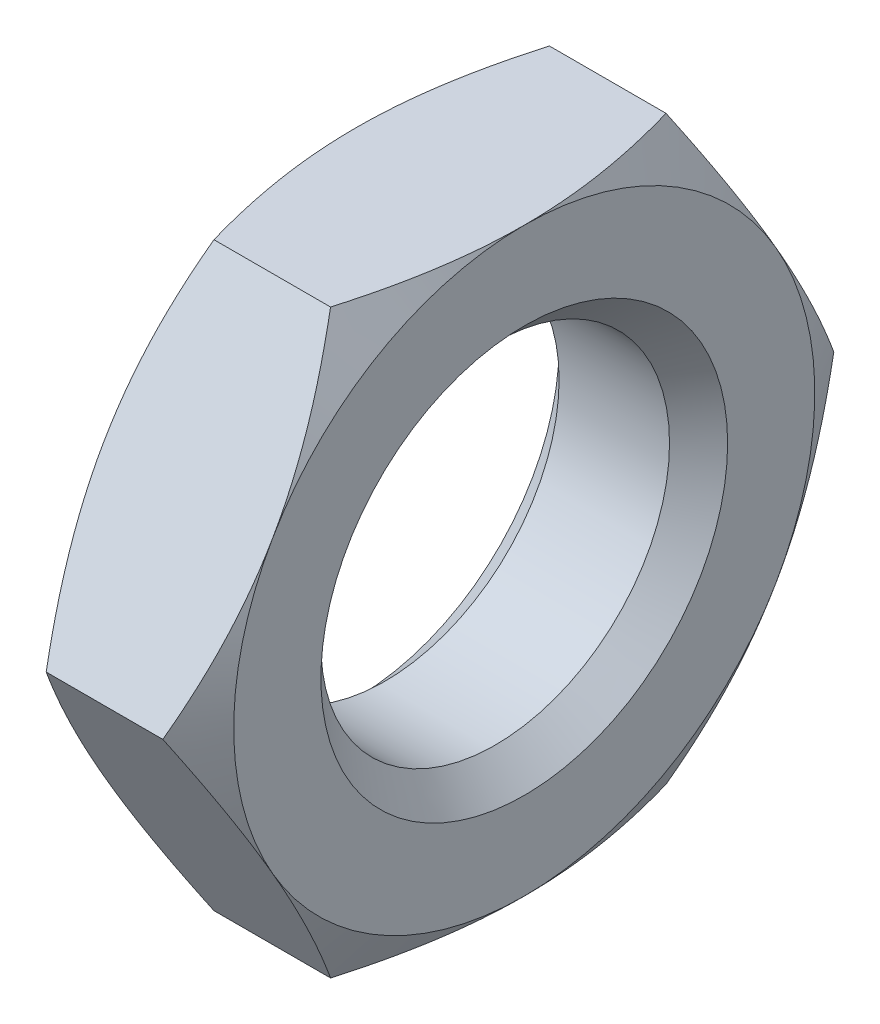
from build123d import *

# Parameters (mm, degrees)
SKETCH1_R      = 3
EXTRUDE1_DEPTH = 2.9
CHAMFER1_SIZE  = 0.5


with BuildPart() as part:
    # Sketch1 → Extrude1 (new body)
    with BuildSketch(Plane(origin=(0, 0, 0), x_dir=(0, 0, -1), z_dir=(1, 0, 0))):
        Polygon((2.886751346, 5), (-2.886751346, 5), (-5.773502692, 0), (-2.886751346, -5), (2.886751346, -5), (5.773502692, 0), align=None)
        Circle(SKETCH1_R, mode=Mode.SUBTRACT)
    extrude(amount=EXTRUDE1_DEPTH)

    # Sketch2 → Cut-Revolve1 (revolve, cut)
    with BuildSketch(Plane.XY):
        Polygon((2.9, 5), (2.9, 20), (0, 20), (0, 5), (1.45, 7.511473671), align=None)
    revolve(axis=Axis((2.9, 0, 0), (-1, 0, 0)), mode=Mode.SUBTRACT)

    # Chamfer1
    chamfer1_edges = [part.edges().sort_by_distance(p)[0] for p in [
        (0, 0, 3),
        (2.9, 0, 3),
    ]]
    chamfer(chamfer1_edges, length=CHAMFER1_SIZE)


solid = part.part
